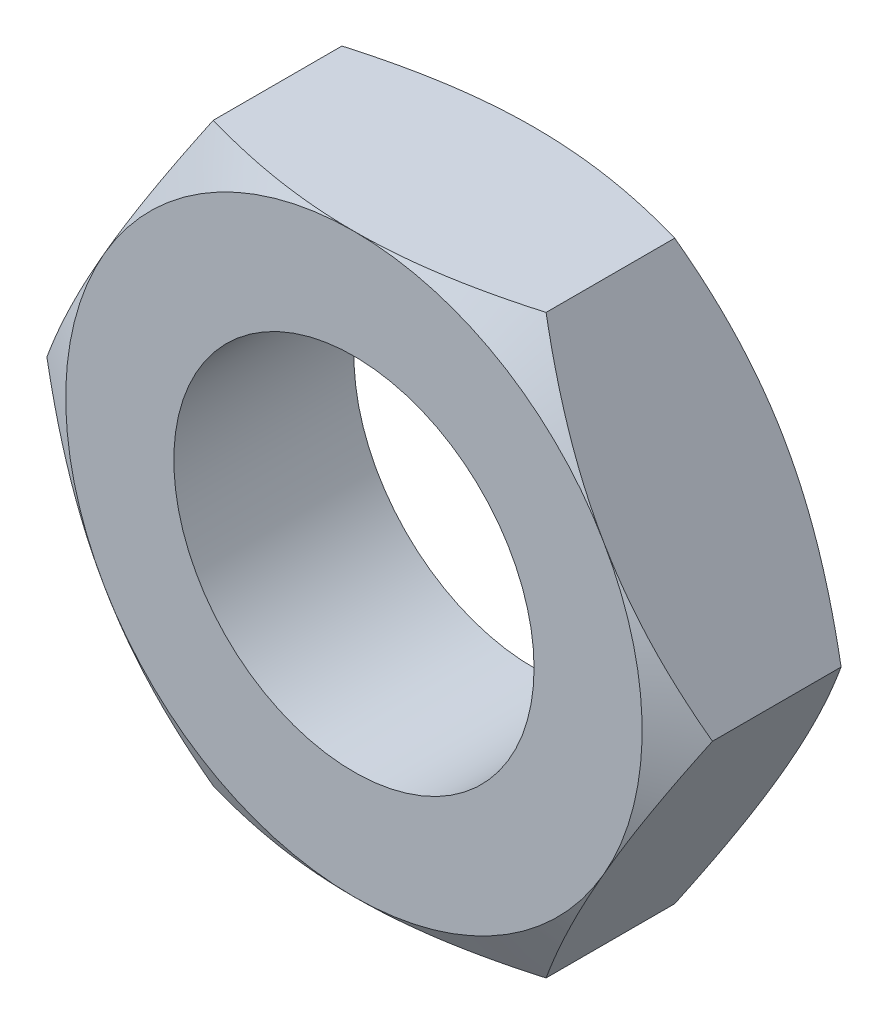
from build123d import *

# Parameters (mm, degrees)
SKETCH1_R      = 5
EXTRUDE1_DEPTH = 2.5


with BuildPart() as part:
    # Sketch1 → Extrude1 (new, symmetric)
    with BuildSketch(Plane.XY):
        Polygon((4.618802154, 8), (-4.618802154, 8), (-9.237604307, 0), (-4.618802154, -8), (4.618802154, -8), (9.237604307, 0), align=None)
        Circle(SKETCH1_R, mode=Mode.SUBTRACT)
    extrude(amount=EXTRUDE1_DEPTH, both=True)

    # Sketch2 → Cut-Revolve1 (revolve, cut)
    with BuildSketch(Plane(origin=(0, 0, 0), x_dir=(0, 0, -1), z_dir=(1, 0, 0))):
        Polygon((-2.5, 8), (-2.5, 16), (2.118802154, 16), align=None)
    cut_revolve1 = revolve(axis=Axis((0, 0, 2.5), (0, 0, -1)), mode=Mode.SUBTRACT)

    # Mirror1: Cut-Revolve1 across plane
    add(cut_revolve1.mirror(Plane.XY), mode=Mode.SUBTRACT)


solid = part.part
